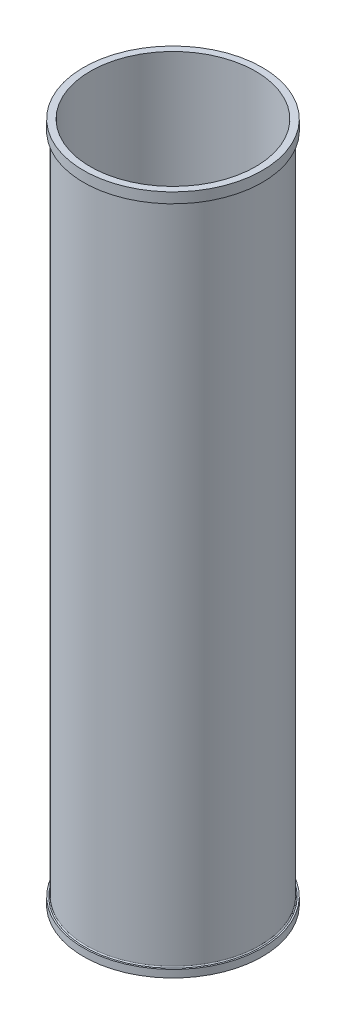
from build123d import *


with BuildPart() as part:
    # Sketch1 → Revolve1 (revolve)
    with BuildSketch(Plane.XY, mode=Mode.PRIVATE) as revolve1_sk:
        Polygon((-109.5375, 838.2), (-101.3587, 838.2), (-101.3587, 0), (-103.3907, 0), (-109.5375, 3.548856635), align=None)
    revolve(revolve1_sk.sketch.rotate(Axis((0, 0, 0), (0, 1, 0)), 270), axis=Axis((0, 0, 0), (0, 1, 0)))

    # Sketch2 → Cut-Revolve1 (revolve, cut)
    with BuildSketch(Plane.XY, mode=Mode.PRIVATE) as cut_revolve1_sk:
        with BuildLine():
            Line((-109.5375, 825.5), (-109.5375, 12.7))
            Line((-109.5375, 12.7), (-107.7087, 12.7))
            ThreePointArc((-107.7087, 12.7), (-106.810674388, 13.071974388), (-106.4387, 13.97))
            Line((-106.4387, 13.97), (-106.4387, 824.23))
            ThreePointArc((-106.4387, 824.23), (-106.810674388, 825.128025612), (-107.7087, 825.5))
            Line((-107.7087, 825.5), (-109.5375, 825.5))
        make_face()
    revolve(cut_revolve1_sk.sketch.rotate(Axis((0, 0, 0), (0, 1, 0)), 270), axis=Axis((0, 0, 0), (0, 1, 0)), mode=Mode.SUBTRACT)


solid = part.part
